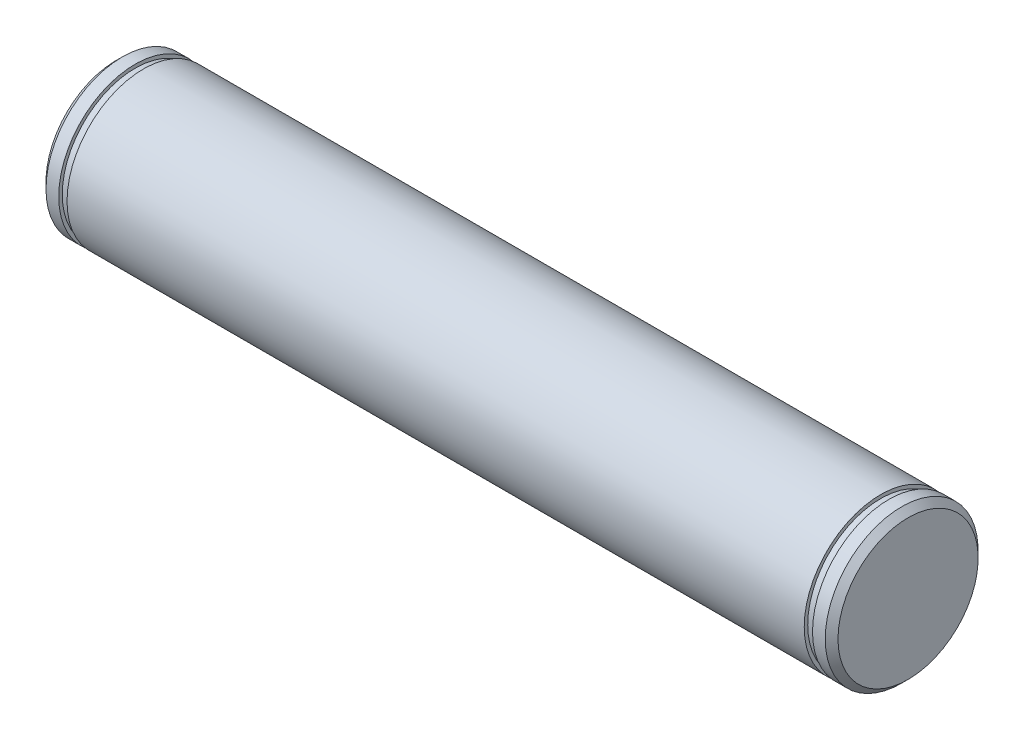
ISO-10303-21;
HEADER;
FILE_DESCRIPTION(('STEP AP214'),'2;1');
FILE_NAME('part.step','',(''),(''),'','','');
FILE_SCHEMA(('AUTOMOTIVE_DESIGN { 1 0 10303 214 1 1 1 1 }'));
ENDSEC;
DATA;
#1=APPLICATION_CONTEXT('core data for automotive mechanical design processes');
#2=APPLICATION_PROTOCOL_DEFINITION('international standard','automotive_design',2000,#1);
#3=PRODUCT_CONTEXT('',#1,'mechanical');
#4=PRODUCT('Part','Part','',(#3));
#5=PRODUCT_RELATED_PRODUCT_CATEGORY('part','',(#4));
#6=PRODUCT_DEFINITION_FORMATION('','',#4);
#7=PRODUCT_DEFINITION_CONTEXT('part definition',#1,'design');
#8=PRODUCT_DEFINITION('design','',#6,#7);
#9=PRODUCT_DEFINITION_SHAPE('','',#8);
#10=(LENGTH_UNIT() NAMED_UNIT(*) SI_UNIT(.MILLI.,.METRE.));
#11=(NAMED_UNIT(*) PLANE_ANGLE_UNIT() SI_UNIT($,.RADIAN.));
#12=(NAMED_UNIT(*) SI_UNIT($,.STERADIAN.) SOLID_ANGLE_UNIT());
#13=UNCERTAINTY_MEASURE_WITH_UNIT(LENGTH_MEASURE(1.E-05),#10,'distance_accuracy_value','');
#14=(GEOMETRIC_REPRESENTATION_CONTEXT(3) GLOBAL_UNCERTAINTY_ASSIGNED_CONTEXT((#13)) GLOBAL_UNIT_ASSIGNED_CONTEXT((#10,
#11,#12)) REPRESENTATION_CONTEXT('',''));
#15=CARTESIAN_POINT('',(0.,0.,0.));
#16=DIRECTION('',(0.,0.,1.));
#17=DIRECTION('',(1.,0.,0.));
#18=AXIS2_PLACEMENT_3D('',#15,#16,#17);
#19=CARTESIAN_POINT('',(-130.,0.,0.));
#20=DIRECTION('',(-1.,0.,0.));
#21=DIRECTION('',(0.,0.,1.));
#22=AXIS2_PLACEMENT_3D('',#19,#20,#21);
#23=CYLINDRICAL_SURFACE('',#22,12.);
#24=CARTESIAN_POINT('',(-99.,0.,0.));
#25=DIRECTION('',(1.,0.,0.));
#26=DIRECTION('',(0.,0.,-1.));
#27=AXIS2_PLACEMENT_3D('',#24,#25,#26);
#28=CIRCLE('',#27,12.);
#29=CARTESIAN_POINT('',(-99.,0.,-12.));
#30=VERTEX_POINT('',#29);
#31=EDGE_CURVE('E44',#30,#30,#28,.T.);
#32=ORIENTED_EDGE('',*,*,#31,.T.);
#33=EDGE_LOOP('',(#32));
#34=FACE_BOUND('',#33,.T.);
#35=CARTESIAN_POINT('',(-97.,0.,0.));
#36=DIRECTION('',(-1.,0.,0.));
#37=DIRECTION('',(0.,0.,1.));
#38=AXIS2_PLACEMENT_3D('',#35,#36,#37);
#39=CIRCLE('',#38,12.);
#40=CARTESIAN_POINT('',(-97.,0.,12.));
#41=VERTEX_POINT('',#40);
#42=EDGE_CURVE('E80',#41,#41,#39,.T.);
#43=ORIENTED_EDGE('',*,*,#42,.T.);
#44=EDGE_LOOP('',(#43));
#45=FACE_BOUND('',#44,.T.);
#46=ADVANCED_FACE('F34',(#34,#45),#23,.T.);
#47=CARTESIAN_POINT('',(-97.,12.,0.));
#48=DIRECTION('',(-1.,0.,0.));
#49=DIRECTION('',(0.,0.,1.));
#50=AXIS2_PLACEMENT_3D('',#47,#48,#49);
#51=PLANE('',#50);
#52=ORIENTED_EDGE('',*,*,#42,.F.);
#53=EDGE_LOOP('',(#52));
#54=FACE_BOUND('',#53,.T.);
#55=CARTESIAN_POINT('',(-97.,0.,0.));
#56=DIRECTION('',(-1.,0.,0.));
#57=DIRECTION('',(0.,0.,1.));
#58=AXIS2_PLACEMENT_3D('',#55,#56,#57);
#59=CIRCLE('',#58,11.45);
#60=CARTESIAN_POINT('',(-97.,0.,11.45));
#61=VERTEX_POINT('',#60);
#62=EDGE_CURVE('E77',#61,#61,#59,.T.);
#63=ORIENTED_EDGE('',*,*,#62,.T.);
#64=EDGE_LOOP('',(#63));
#65=FACE_BOUND('',#64,.T.);
#66=ADVANCED_FACE('F119',(#54,#65),#51,.F.);
#67=CARTESIAN_POINT('',(-130.,0.,0.));
#68=DIRECTION('',(-1.,0.,0.));
#69=DIRECTION('',(0.,0.,1.));
#70=AXIS2_PLACEMENT_3D('',#67,#68,#69);
#71=CYLINDRICAL_SURFACE('',#70,11.45);
#72=ORIENTED_EDGE('',*,*,#62,.F.);
#73=EDGE_LOOP('',(#72));
#74=FACE_BOUND('',#73,.T.);
#75=CARTESIAN_POINT('',(-95.7,0.,0.));
#76=DIRECTION('',(-1.,0.,0.));
#77=DIRECTION('',(0.,0.,1.));
#78=AXIS2_PLACEMENT_3D('',#75,#76,#77);
#79=CIRCLE('',#78,11.45);
#80=CARTESIAN_POINT('',(-95.7,0.,11.45));
#81=VERTEX_POINT('',#80);
#82=EDGE_CURVE('E68',#81,#81,#79,.T.);
#83=ORIENTED_EDGE('',*,*,#82,.T.);
#84=EDGE_LOOP('',(#83));
#85=FACE_BOUND('',#84,.T.);
#86=ADVANCED_FACE('F123',(#74,#85),#71,.T.);
#87=CARTESIAN_POINT('',(-95.7,12.,0.));
#88=DIRECTION('',(1.,0.,0.));
#89=DIRECTION('',(0.,0.,-1.));
#90=AXIS2_PLACEMENT_3D('',#87,#88,#89);
#91=PLANE('',#90);
#92=ORIENTED_EDGE('',*,*,#82,.F.);
#93=EDGE_LOOP('',(#92));
#94=FACE_BOUND('',#93,.T.);
#95=CARTESIAN_POINT('',(-95.7,0.,0.));
#96=DIRECTION('',(-1.,0.,0.));
#97=DIRECTION('',(0.,0.,1.));
#98=AXIS2_PLACEMENT_3D('',#95,#96,#97);
#99=CIRCLE('',#98,12.);
#100=CARTESIAN_POINT('',(-95.7,0.,12.));
#101=VERTEX_POINT('',#100);
#102=EDGE_CURVE('E61',#101,#101,#99,.T.);
#103=ORIENTED_EDGE('',*,*,#102,.T.);
#104=EDGE_LOOP('',(#103));
#105=FACE_BOUND('',#104,.T.);
#106=ADVANCED_FACE('F57',(#94,#105),#91,.F.);
#107=CARTESIAN_POINT('',(-130.,0.,0.));
#108=DIRECTION('',(-1.,0.,0.));
#109=DIRECTION('',(0.,0.,1.));
#110=AXIS2_PLACEMENT_3D('',#107,#108,#109);
#111=CYLINDRICAL_SURFACE('',#110,12.);
#112=CARTESIAN_POINT('',(-42.7453438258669,-11.66205599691,-2.8278026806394));
#113=CARTESIAN_POINT('',(-42.9259179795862,-11.7131861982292,-2.61693458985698));
#114=CARTESIAN_POINT('',(-43.0897365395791,-11.7619439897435,-2.39090102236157));
#115=CARTESIAN_POINT('',(-43.3748943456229,-11.8492493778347,-1.91160391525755));
#116=CARTESIAN_POINT('',(-43.4962916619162,-11.8878109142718,-1.65837822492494));
#117=CARTESIAN_POINT('',(-43.6664134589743,-11.9426707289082,-1.18969846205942));
#118=CARTESIAN_POINT('',(-43.7252715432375,-11.9620063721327,-0.978272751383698));
#119=CARTESIAN_POINT('',(-43.80828507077,-11.9894114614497,-0.548024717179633));
#120=CARTESIAN_POINT('',(-43.8324658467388,-11.9974891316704,-0.329207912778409));
#121=CARTESIAN_POINT('',(-43.8445269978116,-12.0015085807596,0.109870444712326));
#122=CARTESIAN_POINT('',(-43.832352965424,-11.9974321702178,0.330133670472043));
#123=CARTESIAN_POINT('',(-43.7724363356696,-11.9775587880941,0.765224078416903));
#124=CARTESIAN_POINT('',(-43.7246819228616,-11.9617579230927,0.980049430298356));
#125=CARTESIAN_POINT('',(-43.5974377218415,-11.9203413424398,1.39594294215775));
#126=CARTESIAN_POINT('',(-43.51835669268,-11.8948522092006,1.59715066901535));
#127=CARTESIAN_POINT('',(-43.3324925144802,-11.8363050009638,1.9850522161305));
#128=CARTESIAN_POINT('',(-43.2257005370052,-11.803244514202,2.1717413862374));
#129=CARTESIAN_POINT('',(-42.9727623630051,-11.7272697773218,2.55218631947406));
#130=CARTESIAN_POINT('',(-42.8232657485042,-11.683629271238,2.74355863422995));
#131=CARTESIAN_POINT('',(-42.4995602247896,-11.5932930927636,3.1032255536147));
#132=CARTESIAN_POINT('',(-42.3253357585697,-11.5465955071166,3.27150549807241));
#133=CARTESIAN_POINT('',(-41.9180704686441,-11.443558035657,3.61718267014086));
#134=CARTESIAN_POINT('',(-41.6803592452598,-11.387251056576,3.78908310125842));
#135=CARTESIAN_POINT('',(-41.181896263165,-11.2798541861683,4.09776291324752));
#136=CARTESIAN_POINT('',(-40.9211275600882,-11.2287681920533,4.23451617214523));
#137=CARTESIAN_POINT('',(-40.4933328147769,-11.1552575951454,4.42332542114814));
#138=CARTESIAN_POINT('',(-40.3318838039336,-11.1296888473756,4.48707861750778));
#139=CARTESIAN_POINT('',(-40.0040397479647,-11.0826154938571,4.60212023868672));
#140=CARTESIAN_POINT('',(-39.8376458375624,-11.0611099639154,4.6534114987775));
#141=CARTESIAN_POINT('',(-39.5008872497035,-11.0228084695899,4.74342555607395));
#142=CARTESIAN_POINT('',(-39.3305208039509,-11.0060146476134,4.78214263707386));
#143=CARTESIAN_POINT('',(-38.9870188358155,-10.9776741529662,4.84684623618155));
#144=CARTESIAN_POINT('',(-38.8138843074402,-10.9661256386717,4.87283722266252));
#145=CARTESIAN_POINT('',(-38.4563571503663,-10.9481569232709,4.91308234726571));
#146=CARTESIAN_POINT('',(-38.2718670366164,-10.9420520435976,4.92661614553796));
#147=CARTESIAN_POINT('',(-37.9022860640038,-10.9363009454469,4.93936938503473));
#148=CARTESIAN_POINT('',(-37.7171951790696,-10.9366550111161,4.93858819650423));
#149=CARTESIAN_POINT('',(-37.3477571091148,-10.9438091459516,4.92271436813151));
#150=CARTESIAN_POINT('',(-37.1634099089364,-10.9506090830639,4.90762202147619));
#151=CARTESIAN_POINT('',(-36.7967794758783,-10.9704108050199,4.86319611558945));
#152=CARTESIAN_POINT('',(-36.6144962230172,-10.9834125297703,4.83386269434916));
#153=CARTESIAN_POINT('',(-36.2543413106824,-11.0150660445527,4.76128923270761));
#154=CARTESIAN_POINT('',(-36.076450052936,-11.0336842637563,4.71813172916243));
#155=CARTESIAN_POINT('',(-35.7251440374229,-11.075971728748,4.61798694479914));
#156=CARTESIAN_POINT('',(-35.5517310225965,-11.09964290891,4.56099436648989));
#157=CARTESIAN_POINT('',(-35.2105493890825,-11.1512642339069,4.43328889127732));
#158=CARTESIAN_POINT('',(-35.0427847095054,-11.1792172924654,4.36256664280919));
#159=CARTESIAN_POINT('',(-34.7141975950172,-11.2384886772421,4.20752431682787));
#160=CARTESIAN_POINT('',(-34.5533776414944,-11.2698081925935,4.12319942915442));
#161=CARTESIAN_POINT('',(-34.23936500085,-11.3349247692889,3.94067357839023));
#162=CARTESIAN_POINT('',(-34.086208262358,-11.3687319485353,3.84241424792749));
#163=CARTESIAN_POINT('',(-33.7897148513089,-11.4375706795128,3.63238076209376));
#164=CARTESIAN_POINT('',(-33.6463787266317,-11.4726022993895,3.52060585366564));
#165=CARTESIAN_POINT('',(-33.3714747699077,-11.5425788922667,3.28390991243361));
#166=CARTESIAN_POINT('',(-33.2398826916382,-11.577523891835,3.15901718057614));
#167=CARTESIAN_POINT('',(-32.9900705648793,-11.6460556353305,2.89617513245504));
#168=CARTESIAN_POINT('',(-32.8718491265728,-11.6796425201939,2.75822717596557));
#169=CARTESIAN_POINT('',(-32.6129839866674,-11.755096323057,2.42014908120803));
#170=CARTESIAN_POINT('',(-32.4785594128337,-11.795851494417,2.21492062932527));
#171=CARTESIAN_POINT('',(-32.2439364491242,-11.8686170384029,1.78419546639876));
#172=CARTESIAN_POINT('',(-32.1437065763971,-11.9006354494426,1.55871764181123));
#173=CARTESIAN_POINT('',(-32.0232861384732,-11.9396002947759,1.20831209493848));
#174=CARTESIAN_POINT('',(-31.988043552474,-11.9511090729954,1.08891474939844));
#175=CARTESIAN_POINT('',(-31.9284384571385,-11.9706703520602,0.847181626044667));
#176=CARTESIAN_POINT('',(-31.9040704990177,-11.9787245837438,0.724847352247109));
#177=CARTESIAN_POINT('',(-31.8667256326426,-11.9910992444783,0.478292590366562));
#178=CARTESIAN_POINT('',(-31.8537454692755,-11.9954207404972,0.354072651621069));
#179=CARTESIAN_POINT('',(-31.8394291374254,-12.0001895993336,0.104931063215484));
#180=CARTESIAN_POINT('',(-31.8380916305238,-12.0006374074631,-0.0199905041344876));
#181=CARTESIAN_POINT('',(-31.8505611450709,-11.9964777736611,-0.363563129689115));
#182=CARTESIAN_POINT('',(-31.8765503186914,-11.9878031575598,-0.581850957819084));
#183=CARTESIAN_POINT('',(-31.9629376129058,-11.959309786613,-1.01056283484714));
#184=CARTESIAN_POINT('',(-32.0233397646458,-11.9394897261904,-1.22098595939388));
#185=CARTESIAN_POINT('',(-32.1753759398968,-11.8905395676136,-1.63027786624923));
#186=CARTESIAN_POINT('',(-32.2671784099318,-11.8613593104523,-1.82907741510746));
#187=CARTESIAN_POINT('',(-32.4775723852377,-11.7962123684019,-2.21063820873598));
#188=CARTESIAN_POINT('',(-32.5961735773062,-11.7602432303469,-2.39339362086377));
#189=CARTESIAN_POINT('',(-32.8762554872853,-11.6781364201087,-2.76830585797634));
#190=CARTESIAN_POINT('',(-33.0415425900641,-11.6312884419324,-2.95745334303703));
#191=CARTESIAN_POINT('',(-33.3965333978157,-11.5357316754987,-3.31065474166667));
#192=CARTESIAN_POINT('',(-33.586254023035,-11.4870216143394,-3.47469109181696));
#193=CARTESIAN_POINT('',(-34.0278650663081,-11.3809489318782,-3.80933757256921));
#194=CARTESIAN_POINT('',(-34.2843991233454,-11.3239474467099,-3.97393609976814));
#195=CARTESIAN_POINT('',(-34.8198345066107,-11.2175262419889,-4.26511506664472));
#196=CARTESIAN_POINT('',(-35.098751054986,-11.1681117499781,-4.39166935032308));
#197=CARTESIAN_POINT('',(-35.5516035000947,-11.0997023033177,-4.56081251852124));
#198=CARTESIAN_POINT('',(-35.720241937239,-11.0766640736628,-4.61630997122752));
#199=CARTESIAN_POINT('',(-36.0618300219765,-11.0353476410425,-4.71422795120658));
#200=CARTESIAN_POINT('',(-36.2347785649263,-11.0170682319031,-4.75665179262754));
#201=CARTESIAN_POINT('',(-36.583907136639,-10.9858552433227,-4.82830300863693));
#202=CARTESIAN_POINT('',(-36.7600880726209,-10.9729231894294,-4.85752661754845));
#203=CARTESIAN_POINT('',(-37.1144108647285,-10.9528394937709,-4.90264401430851));
#204=CARTESIAN_POINT('',(-37.2925519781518,-10.9456857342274,-4.91854268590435));
#205=CARTESIAN_POINT('',(-37.655570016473,-10.9372549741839,-4.93726302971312));
#206=CARTESIAN_POINT('',(-37.8404750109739,-10.936179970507,-4.93963523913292));
#207=CARTESIAN_POINT('',(-38.2098452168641,-10.9404874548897,-4.930087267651));
#208=CARTESIAN_POINT('',(-38.3943104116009,-10.9458701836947,-4.91816655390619));
#209=CARTESIAN_POINT('',(-38.7615803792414,-10.9629049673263,-4.8800767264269));
#210=CARTESIAN_POINT('',(-38.9443841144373,-10.9745606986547,-4.8538992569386));
#211=CARTESIAN_POINT('',(-39.3069207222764,-11.0037309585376,-4.787402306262));
#212=CARTESIAN_POINT('',(-39.4866536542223,-11.0212453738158,-4.74708309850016));
#213=CARTESIAN_POINT('',(-39.8412777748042,-11.0614690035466,-4.65258315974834));
#214=CARTESIAN_POINT('',(-40.0161814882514,-11.0841630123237,-4.59844294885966));
#215=CARTESIAN_POINT('',(-40.3605398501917,-11.1340241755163,-4.47636603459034));
#216=CARTESIAN_POINT('',(-40.5299920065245,-11.1611933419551,-4.40842312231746));
#217=CARTESIAN_POINT('',(-40.8618874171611,-11.2190625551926,-4.25899552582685));
#218=CARTESIAN_POINT('',(-41.024340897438,-11.249757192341,-4.17753150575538));
#219=CARTESIAN_POINT('',(-41.3412183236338,-11.313707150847,-4.0011038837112));
#220=CARTESIAN_POINT('',(-41.4956416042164,-11.3469626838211,-3.90613916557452));
#221=CARTESIAN_POINT('',(-41.8488313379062,-11.4271480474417,-3.66626921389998));
#222=CARTESIAN_POINT('',(-42.0436441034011,-11.4747054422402,-3.51566644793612));
#223=CARTESIAN_POINT('',(-42.4118163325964,-11.5694828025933,-3.1899571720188));
#224=CARTESIAN_POINT('',(-42.5851717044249,-11.6167027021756,-3.0148460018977));
#225=CARTESIAN_POINT('',(-42.7453438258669,-11.66205599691,-2.8278026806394));
#226=B_SPLINE_CURVE_WITH_KNOTS('',3,(#112,#113,#114,#115,#116,#117,#118,#119,#120,#121,#122,
#123,#124,#125,#126,#127,#128,#129,#130,#131,#132,#133,#134,#135,#136,#137,#138,#139,#140,#141,
#142,#143,#144,#145,#146,#147,#148,#149,#150,#151,#152,#153,#154,#155,#156,#157,#158,#159,#160,
#161,#162,#163,#164,#165,#166,#167,#168,#169,#170,#171,#172,#173,#174,#175,#176,#177,#178,#179,
#180,#181,#182,#183,#184,#185,#186,#187,#188,#189,#190,#191,#192,#193,#194,#195,#196,#197,#198,
#199,#200,#201,#202,#203,#204,#205,#206,#207,#208,#209,#210,#211,#212,#213,#214,#215,#216,#217,
#218,#219,#220,#221,#222,#223,#224,#225),.UNSPECIFIED.,.T.,.F.,(4,2,2,2,2,2,2,2,2,2,2,2,2,2,2,2,
2,2,2,2,2,2,2,2,2,2,2,2,2,2,2,2,2,2,2,2,2,2,2,2,2,2,2,2,2,2,2,2,2,2,2,2,2,2,2,2,4),(0.,
0.846045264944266,1.690927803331,2.34899912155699,3.00658945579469,3.66516441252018,
4.32395816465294,4.97442487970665,5.6250990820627,6.3626324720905,7.1006319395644,
7.99349472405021,8.88701919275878,9.4128909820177,9.93864301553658,10.4646337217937,
10.9904396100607,11.5450275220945,12.0996398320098,12.6542407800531,13.2088363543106,
13.7601805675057,14.311736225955,14.8636688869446,15.4157971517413,15.9703104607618,
16.5248546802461,17.0782261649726,17.6315400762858,18.374653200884,19.1170802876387,
19.4916735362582,19.8660788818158,20.2403771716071,20.6146324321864,21.2711368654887,
21.9277182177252,22.5878785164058,23.2482778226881,24.0120927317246,24.7764394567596,
25.7032251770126,26.6306466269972,27.1672036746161,27.7036245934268,28.2401984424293,
28.7765755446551,29.330676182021,29.8847974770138,30.4392438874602,30.9936795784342,
31.5465080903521,32.0995858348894,32.6518259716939,33.2041117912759,33.9544244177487,
34.7048799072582),.UNSPECIFIED.);
#227=CARTESIAN_POINT('',(-42.7453438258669,-11.66205599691,-2.8278026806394));
#228=VERTEX_POINT('',#227);
#229=EDGE_CURVE('E11',#228,#228,#226,.T.);
#230=ORIENTED_EDGE('',*,*,#229,.T.);
#231=EDGE_LOOP('',(#230));
#232=FACE_BOUND('',#231,.T.);
#233=ORIENTED_EDGE('',*,*,#102,.F.);
#234=EDGE_LOOP('',(#233));
#235=FACE_BOUND('',#234,.T.);
#236=CARTESIAN_POINT('',(20.02,0.,0.));
#237=DIRECTION('',(-1.,0.,0.));
#238=DIRECTION('',(0.,0.,1.));
#239=AXIS2_PLACEMENT_3D('',#236,#237,#238);
#240=CIRCLE('',#239,12.);
#241=CARTESIAN_POINT('',(20.02,0.,12.));
#242=VERTEX_POINT('',#241);
#243=EDGE_CURVE('E64',#242,#242,#240,.T.);
#244=ORIENTED_EDGE('',*,*,#243,.T.);
#245=EDGE_LOOP('',(#244));
#246=FACE_BOUND('',#245,.T.);
#247=ADVANCED_FACE('F53',(#232,#235,#246),#111,.T.);
#248=CARTESIAN_POINT('',(20.02,12.,0.));
#249=DIRECTION('',(-1.,0.,0.));
#250=DIRECTION('',(0.,0.,1.));
#251=AXIS2_PLACEMENT_3D('',#248,#249,#250);
#252=PLANE('',#251);
#253=ORIENTED_EDGE('',*,*,#243,.F.);
#254=EDGE_LOOP('',(#253));
#255=FACE_BOUND('',#254,.T.);
#256=CARTESIAN_POINT('',(20.02,0.,0.));
#257=DIRECTION('',(-1.,0.,0.));
#258=DIRECTION('',(0.,0.,1.));
#259=AXIS2_PLACEMENT_3D('',#256,#257,#258);
#260=CIRCLE('',#259,11.45);
#261=CARTESIAN_POINT('',(20.02,0.,11.45));
#262=VERTEX_POINT('',#261);
#263=EDGE_CURVE('E66',#262,#262,#260,.T.);
#264=ORIENTED_EDGE('',*,*,#263,.T.);
#265=EDGE_LOOP('',(#264));
#266=FACE_BOUND('',#265,.T.);
#267=ADVANCED_FACE('F56',(#255,#266),#252,.F.);
#268=CARTESIAN_POINT('',(-130.,0.,0.));
#269=DIRECTION('',(-1.,0.,0.));
#270=DIRECTION('',(0.,0.,1.));
#271=AXIS2_PLACEMENT_3D('',#268,#269,#270);
#272=CYLINDRICAL_SURFACE('',#271,11.45);
#273=ORIENTED_EDGE('',*,*,#263,.F.);
#274=EDGE_LOOP('',(#273));
#275=FACE_BOUND('',#274,.T.);
#276=CARTESIAN_POINT('',(21.32,0.,0.));
#277=DIRECTION('',(-1.,0.,0.));
#278=DIRECTION('',(0.,0.,1.));
#279=AXIS2_PLACEMENT_3D('',#276,#277,#278);
#280=CIRCLE('',#279,11.45);
#281=CARTESIAN_POINT('',(21.32,0.,11.45));
#282=VERTEX_POINT('',#281);
#283=EDGE_CURVE('E71',#282,#282,#280,.T.);
#284=ORIENTED_EDGE('',*,*,#283,.T.);
#285=EDGE_LOOP('',(#284));
#286=FACE_BOUND('',#285,.T.);
#287=ADVANCED_FACE('F139',(#275,#286),#272,.T.);
#288=CARTESIAN_POINT('',(21.32,12.,0.));
#289=DIRECTION('',(1.,0.,0.));
#290=DIRECTION('',(0.,0.,-1.));
#291=AXIS2_PLACEMENT_3D('',#288,#289,#290);
#292=PLANE('',#291);
#293=ORIENTED_EDGE('',*,*,#283,.F.);
#294=EDGE_LOOP('',(#293));
#295=FACE_BOUND('',#294,.T.);
#296=CARTESIAN_POINT('',(21.32,0.,0.));
#297=DIRECTION('',(-1.,0.,0.));
#298=DIRECTION('',(0.,0.,1.));
#299=AXIS2_PLACEMENT_3D('',#296,#297,#298);
#300=CIRCLE('',#299,12.);
#301=CARTESIAN_POINT('',(21.32,0.,12.));
#302=VERTEX_POINT('',#301);
#303=EDGE_CURVE('E155',#302,#302,#300,.T.);
#304=ORIENTED_EDGE('',*,*,#303,.T.);
#305=EDGE_LOOP('',(#304));
#306=FACE_BOUND('',#305,.T.);
#307=ADVANCED_FACE('F142',(#295,#306),#292,.F.);
#308=CARTESIAN_POINT('',(-130.,0.,0.));
#309=DIRECTION('',(-1.,0.,0.));
#310=DIRECTION('',(0.,0.,1.));
#311=AXIS2_PLACEMENT_3D('',#308,#309,#310);
#312=CYLINDRICAL_SURFACE('',#311,12.);
#313=CARTESIAN_POINT('',(23.32,0.,0.));
#314=DIRECTION('',(-1.,0.,0.));
#315=DIRECTION('',(0.,0.,1.));
#316=AXIS2_PLACEMENT_3D('',#313,#314,#315);
#317=CIRCLE('',#316,12.);
#318=CARTESIAN_POINT('',(23.32,0.,12.));
#319=VERTEX_POINT('',#318);
#320=EDGE_CURVE('E84',#319,#319,#317,.T.);
#321=ORIENTED_EDGE('',*,*,#320,.T.);
#322=EDGE_LOOP('',(#321));
#323=FACE_BOUND('',#322,.T.);
#324=ORIENTED_EDGE('',*,*,#303,.F.);
#325=EDGE_LOOP('',(#324));
#326=FACE_BOUND('',#325,.T.);
#327=ADVANCED_FACE('F115',(#323,#326),#312,.T.);
#328=CARTESIAN_POINT('',(24.32,12.,0.));
#329=DIRECTION('',(-1.,0.,0.));
#330=DIRECTION('',(0.,0.,1.));
#331=AXIS2_PLACEMENT_3D('',#328,#329,#330);
#332=PLANE('',#331);
#333=CARTESIAN_POINT('',(24.32,0.,0.));
#334=DIRECTION('',(-1.,0.,0.));
#335=DIRECTION('',(0.,0.,1.));
#336=AXIS2_PLACEMENT_3D('',#333,#334,#335);
#337=CIRCLE('',#336,11.);
#338=CARTESIAN_POINT('',(24.32,0.,11.));
#339=VERTEX_POINT('',#338);
#340=EDGE_CURVE('E88',#339,#339,#337,.F.);
#341=ORIENTED_EDGE('',*,*,#340,.T.);
#342=EDGE_LOOP('',(#341));
#343=FACE_BOUND('',#342,.T.);
#344=ADVANCED_FACE('F107',(#343),#332,.F.);
#345=CARTESIAN_POINT('',(-100.,0.,0.));
#346=DIRECTION('',(1.,0.,0.));
#347=DIRECTION('',(0.,0.,-1.));
#348=AXIS2_PLACEMENT_3D('',#345,#346,#347);
#349=PLANE('',#348);
#350=CARTESIAN_POINT('',(-100.,0.,0.));
#351=DIRECTION('',(1.,0.,0.));
#352=DIRECTION('',(0.,0.,-1.));
#353=AXIS2_PLACEMENT_3D('',#350,#351,#352);
#354=CIRCLE('',#353,11.);
#355=CARTESIAN_POINT('',(-100.,0.,-11.));
#356=VERTEX_POINT('',#355);
#357=EDGE_CURVE('E91',#356,#356,#354,.F.);
#358=ORIENTED_EDGE('',*,*,#357,.T.);
#359=EDGE_LOOP('',(#358));
#360=FACE_BOUND('',#359,.T.);
#361=ADVANCED_FACE('F105',(#360),#349,.F.);
#362=CARTESIAN_POINT('',(23.32,0.,0.));
#363=DIRECTION('',(-1.,0.,0.));
#364=DIRECTION('',(0.,0.,1.));
#365=AXIS2_PLACEMENT_3D('',#362,#363,#364);
#366=CONICAL_SURFACE('',#365,12.,0.785398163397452);
#367=ORIENTED_EDGE('',*,*,#340,.F.);
#368=EDGE_LOOP('',(#367));
#369=FACE_BOUND('',#368,.T.);
#370=ORIENTED_EDGE('',*,*,#320,.F.);
#371=EDGE_LOOP('',(#370));
#372=FACE_BOUND('',#371,.T.);
#373=ADVANCED_FACE('F101',(#369,#372),#366,.T.);
#374=CARTESIAN_POINT('',(-100.,0.,0.));
#375=DIRECTION('',(1.,0.,0.));
#376=DIRECTION('',(0.,0.,-1.));
#377=AXIS2_PLACEMENT_3D('',#374,#375,#376);
#378=CONICAL_SURFACE('',#377,11.,0.785398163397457);
#379=ORIENTED_EDGE('',*,*,#31,.F.);
#380=EDGE_LOOP('',(#379));
#381=FACE_BOUND('',#380,.T.);
#382=ORIENTED_EDGE('',*,*,#357,.F.);
#383=EDGE_LOOP('',(#382));
#384=FACE_BOUND('',#383,.T.);
#385=ADVANCED_FACE('F50',(#381,#384),#378,.T.);
#386=CARTESIAN_POINT('',(-37.84,-6.00000000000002,0.));
#387=DIRECTION('',(0.,-1.,0.));
#388=DIRECTION('',(0.,0.,-1.));
#389=AXIS2_PLACEMENT_3D('',#386,#387,#388);
#390=CONICAL_SURFACE('',#389,0.,0.78539816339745);
#391=CARTESIAN_POINT('',(-37.84,-6.00000000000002,0.));
#392=VERTEX_POINT('',#391);
#393=VERTEX_LOOP('',#392);
#394=FACE_BOUND('',#393,.T.);
#395=ORIENTED_EDGE('',*,*,#229,.F.);
#396=EDGE_LOOP('',(#395));
#397=FACE_BOUND('',#396,.T.);
#398=ADVANCED_FACE('F47',(#394,#397),#390,.F.);
#399=CLOSED_SHELL('',(#46,#66,#86,#106,#247,#267,#287,#307,#327,#344,#361,#373,#385,#398));
#400=MANIFOLD_SOLID_BREP('B2',#399);
#401=ADVANCED_BREP_SHAPE_REPRESENTATION('',(#18,#400),#14);
#402=SHAPE_DEFINITION_REPRESENTATION(#9,#401);
ENDSEC;
END-ISO-10303-21;
